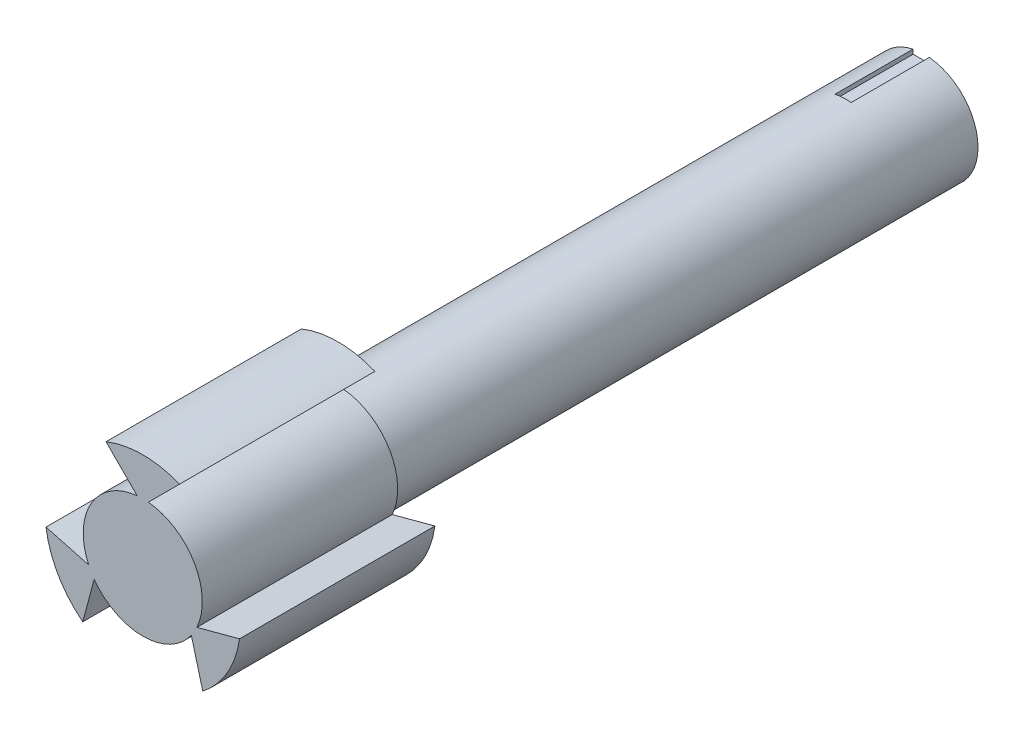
from build123d import *

# Parameters (mm, degrees)
BOSS_EXTRUDE1_DEPTH = 200
SKETCH2_R           = 55
BOSS_EXTRUDE2_DEPTH = 800
SKETCH4_W           = 16.611577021
SKETCH4_H           = 12.619068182
CUT_EXTRUDE1_DEPTH  = 80


with BuildPart() as part:
    # Sketch1 → Boss-Extrude1 (new body)
    with BuildSketch(Plane.XY):
        with BuildLine():
            Line((-5.678147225, 60.678147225), (-37.644071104, 92.644071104))
            ThreePointArc((-37.644071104, 92.644071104), (0, 100), (37.644071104, 92.644071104))
            Line((37.644071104, 92.644071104), (5.678147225, 60.678147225))
            ThreePointArc((5.678147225, 60.678147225), (52.778396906, 30.471621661), (55.387890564, -25.421653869))
            Line((55.387890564, -25.421653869), (99.054154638, -13.721313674))
            ThreePointArc((99.054154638, -13.721313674), (86.602540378, -50), (61.410083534, -78.92275743))
            Line((61.410083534, -78.92275743), (49.709743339, -35.256493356))
            ThreePointArc((49.709743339, -35.256493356), (0, -60.943243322), (-49.709743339, -35.256493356))
            Line((-49.709743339, -35.256493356), (-61.410083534, -78.92275743))
            ThreePointArc((-61.410083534, -78.92275743), (-86.602540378, -50), (-99.054154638, -13.721313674))
            Line((-99.054154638, -13.721313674), (-55.387890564, -25.421653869))
            ThreePointArc((-55.387890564, -25.421653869), (-52.778396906, 30.471621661), (-5.678147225, 60.678147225))
        make_face()
    extrude(amount=BOSS_EXTRUDE1_DEPTH)

    # Sketch2 → Boss-Extrude2 (add)
    with BuildSketch(Plane.XY.offset(200)):
        Circle(SKETCH2_R)
    extrude(amount=-BOSS_EXTRUDE2_DEPTH)

    # Sketch4 → Cut-Extrude1 (cut)
    with BuildSketch(Plane(origin=(0, 0, -600), x_dir=(-1, 0, 0), z_dir=(0, 0, -1))):
        with Locations((3.127329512, 55.580565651)):
            Rectangle(SKETCH4_W, SKETCH4_H)
    extrude(amount=-CUT_EXTRUDE1_DEPTH, mode=Mode.SUBTRACT)


solid = part.part
